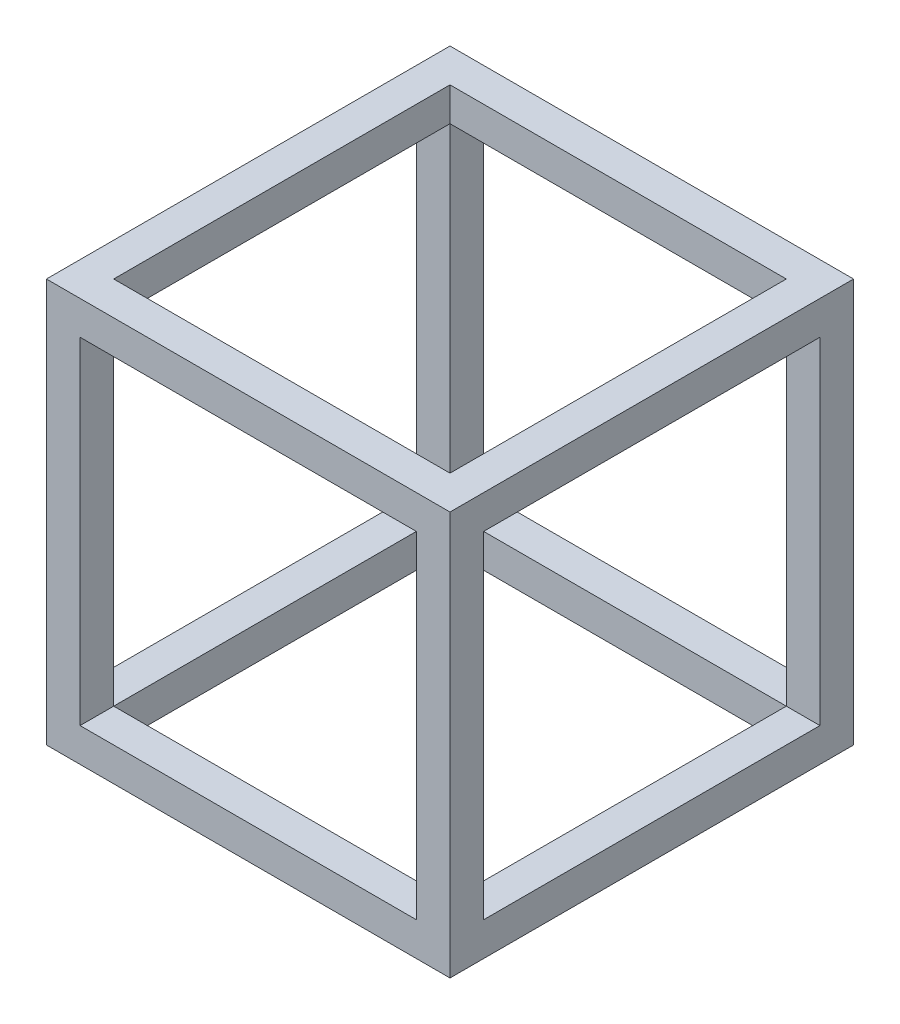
from build123d import *

# Parameters (mm, degrees)
SKETCH1_W          = 76.2
SKETCH1_H          = 76.2
EXTRUDE1_DEPTH     = 38.1
SKETCH2_W          = 63.5
SKETCH2_H          = 63.5
CUT_EXTRUDE1_DEPTH = 94.3255592
SKETCH3_W          = 63.5
SKETCH3_H          = 63.5
CUT_EXTRUDE2_DEPTH = 94.3255592
SKETCH4_W          = 63.5
SKETCH4_H          = 63.5
CUT_EXTRUDE3_DEPTH = 94.3255592


with BuildPart() as part:
    # Sketch1 → Extrude1 (new, symmetric)
    with BuildSketch(Plane.XY):
        Rectangle(SKETCH1_W, SKETCH1_H)
    extrude(amount=EXTRUDE1_DEPTH, both=True)

    # Sketch2 → Cut-Extrude1 (cut, through all)
    with BuildSketch(Plane(origin=(0, 38.1, 0), x_dir=(-1, 0, 0), z_dir=(0, 1, 0))):
        Rectangle(SKETCH2_W, SKETCH2_H)
    extrude(amount=-CUT_EXTRUDE1_DEPTH, mode=Mode.SUBTRACT)

    # Sketch3 → Cut-Extrude2 (cut, through all)
    with BuildSketch(Plane(origin=(38.1, 0, 0), x_dir=(0, 0, -1), z_dir=(1, 0, 0))):
        Rectangle(SKETCH3_W, SKETCH3_H)
    extrude(amount=-CUT_EXTRUDE2_DEPTH, mode=Mode.SUBTRACT)

    # Sketch4 → Cut-Extrude3 (cut, through all)
    with BuildSketch(Plane.XY.offset(38.1)):
        Rectangle(SKETCH4_W, SKETCH4_H)
    extrude(amount=-CUT_EXTRUDE3_DEPTH, mode=Mode.SUBTRACT)


solid = part.part
